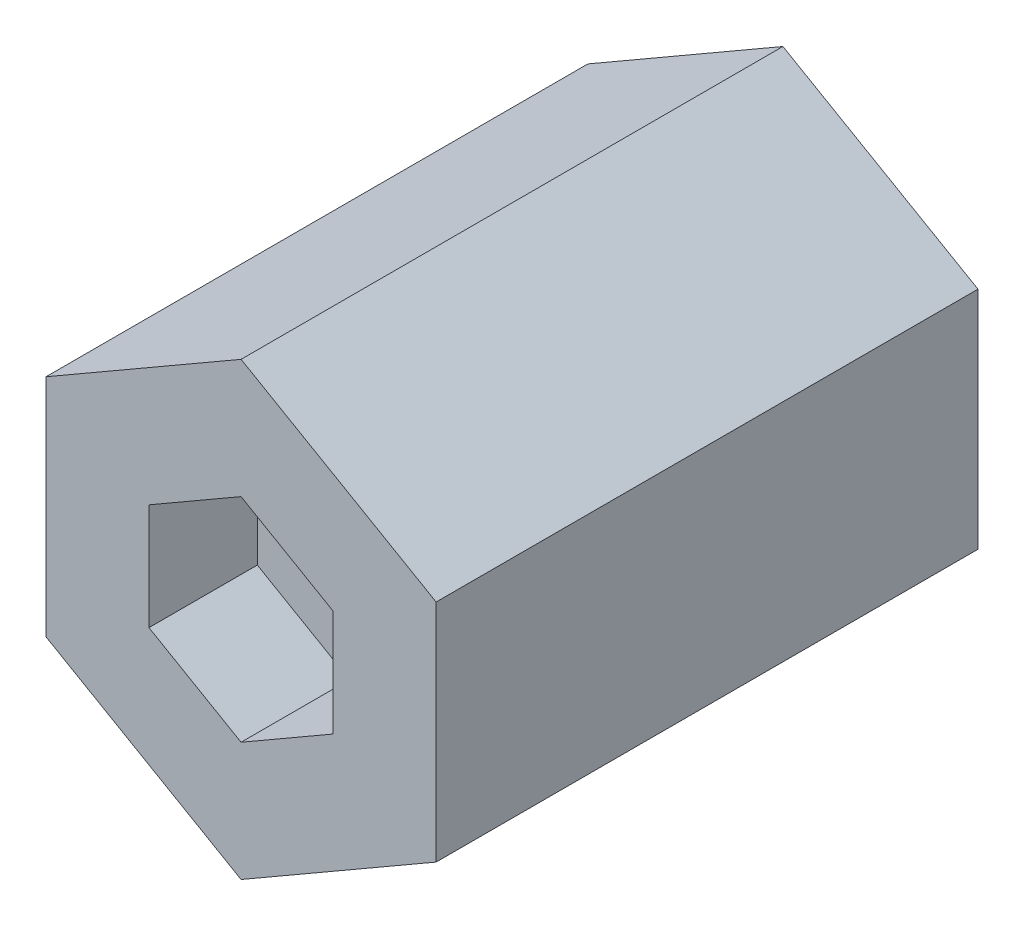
from build123d import *

# Parameters (mm, degrees)
LINEAR_AUSTRAGEN1_DEPTH = 50
LINEAR_AUSTRAGEN2_DEPTH = 10


with BuildPart() as part:
    # Skizze1 → Linear austragen1 (new body)
    with BuildSketch(Plane.XY):
        Polygon((0, 20.784609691), (-18, 10.392304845), (-18, -10.392304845), (0, -20.784609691), (18, -10.392304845), (18, 10.392304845), align=None)
    extrude(amount=LINEAR_AUSTRAGEN1_DEPTH)

    # Skizze2 → Linear austragen2 (cut)
    with BuildSketch(Plane.XY.offset(50)):
        Polygon((0, 9.814954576), (-8.5, 4.907477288), (-8.5, -4.907477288), (0, -9.814954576), (8.5, -4.907477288), (8.5, 4.907477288), align=None)
    extrude(amount=-LINEAR_AUSTRAGEN2_DEPTH, mode=Mode.SUBTRACT)


solid = part.part
